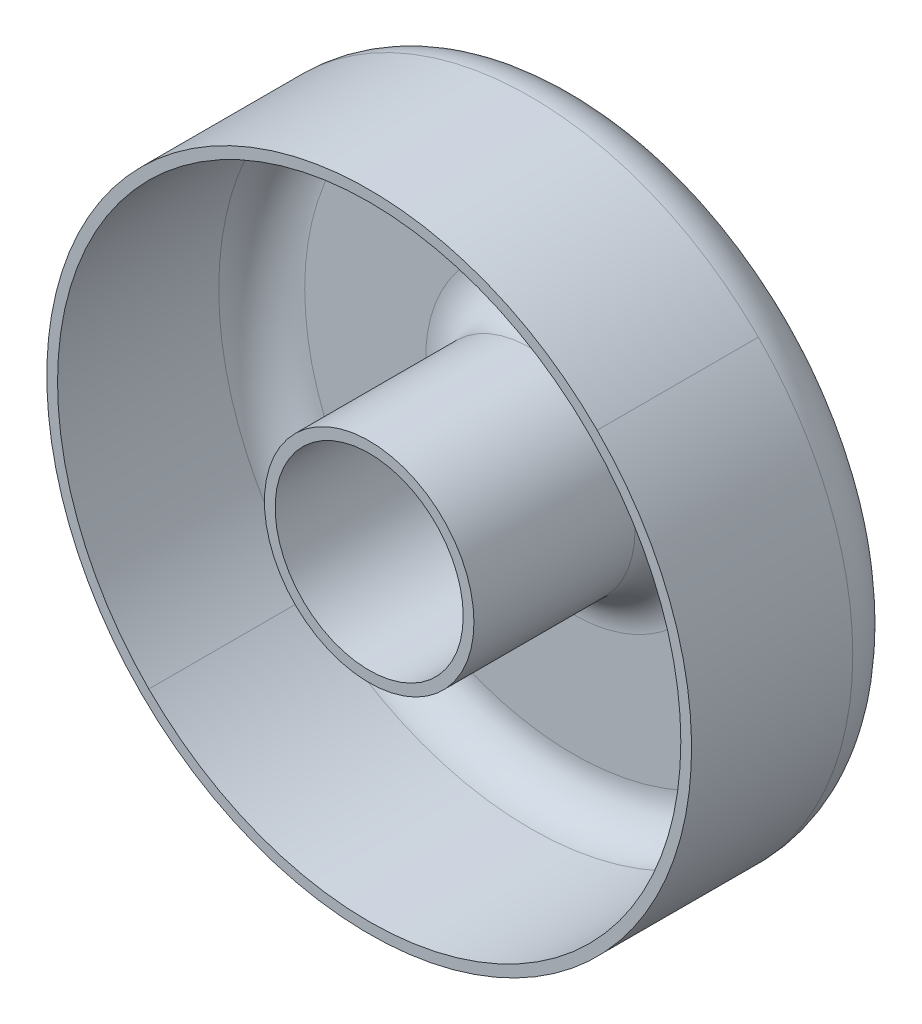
from build123d import *

# Parameters (mm, degrees)
SKETCH1_R          = 60
EXTRUDE1_DEPTH     = 40
SKETCH2_R          = 17.5
CUT_EXTRUDE1_DEPTH = 94.808315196
FILLET1_R          = 10
SHELL1_T           = -2


with BuildPart() as part:
    # Sketch1 → Extrude1 (new body)
    with BuildSketch(Plane.XY):
        Circle(SKETCH1_R)
    extrude(amount=EXTRUDE1_DEPTH)

    # Sketch2 → Cut-Extrude1 (cut, through all)
    with BuildSketch(Plane.XY.offset(40)):
        Circle(SKETCH2_R)
    extrude(amount=-CUT_EXTRUDE1_DEPTH, mode=Mode.SUBTRACT)

    # Fillet1
    fillet1_edges = [part.edges().sort_by_distance(p)[0] for p in [
        (-60, 0, 0),
        (-17.5, 0, 0),
    ]]
    fillet(fillet1_edges, radius=FILLET1_R)

    # Shell1
    shell1_openings = [part.faces().sort_by_distance(p)[0] for p in [
        (-58.302943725, 0, 40),
    ]]
    offset(amount=SHELL1_T, openings=shell1_openings, kind=Kind.INTERSECTION)


solid = part.part
